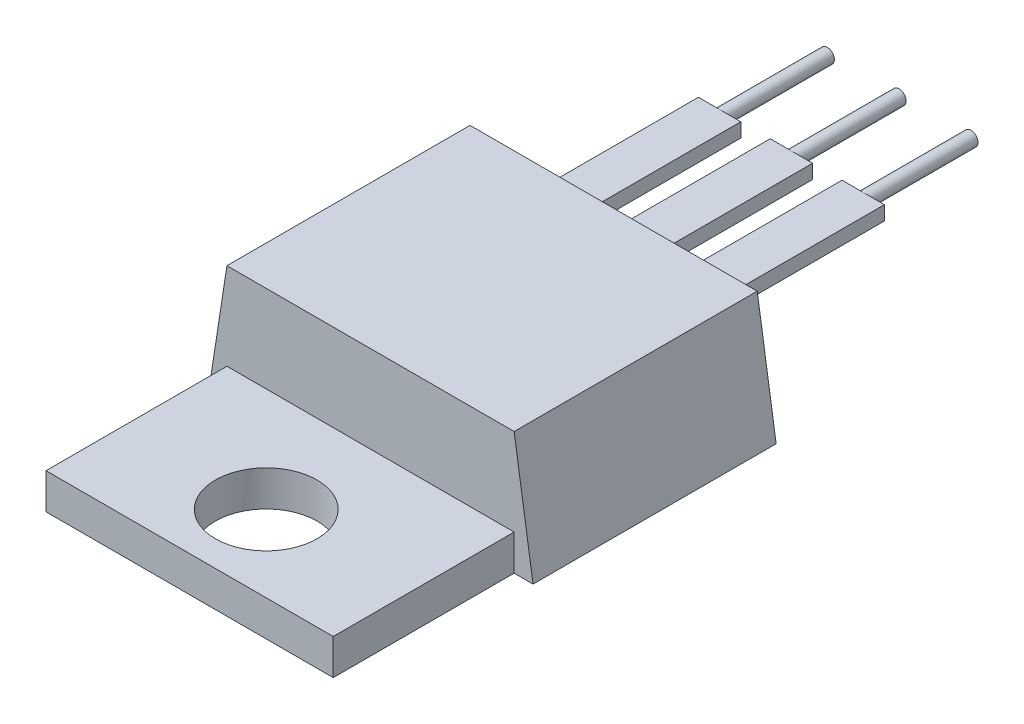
from build123d import *

# Parameters (mm, degrees)
EXTRUDE_1_DEPTH      = 8.6
EXTRUDE_2_DEPTH      = 6.4
EXTRUDE_2_DEPTH_BACK = 7.6
SKETCH_2_W           = 10.16
SKETCH_2_H           = 1.26
SKETCH_3_R           = 1.8
CUT_EXTRUDE_1_DEPTH  = 1.26
SKETCH_4_W           = 1.5
SKETCH_4_H           = 0.5
EXTRUDE_3_DEPTH      = 6.29
EXTRUDE_3_2_DEPTH    = 6.29
EXTRUDE_3_3_DEPTH    = 6.29
SKETCH_5_R           = 0.25
EXTRUDE_4_DEPTH      = 3.81


with BuildPart() as part:
    # Sketch 1 → Extrude 1 (new body)
    with BuildSketch(Plane.XY):
        Polygon((-5.75, -2.7), (5.75, -2.7), (5.08, 1.64), (-5.08, 1.64), align=None)
    extrude(amount=EXTRUDE_1_DEPTH)


with BuildPart() as body_2:
    # Sketch 2 → Extrude 2 (new, two sides: drawn at the far end of the back side and taken through both)
    with BuildSketch(Plane.XY.offset(8.6).offset(-EXTRUDE_2_DEPTH_BACK)):
        with Locations((0, -2.07)):
            Rectangle(SKETCH_2_W, SKETCH_2_H)
    extrude(amount=EXTRUDE_2_DEPTH + EXTRUDE_2_DEPTH_BACK)

    # Sketch 3 → Cut-Extrude 1 (cut)
    with BuildSketch(Plane(origin=(0, -1.44, 0), x_dir=(1, 0, 0), z_dir=(0, 1, 0))):
        with Locations(Location((0, -12.29, 0), (0, 0, 270))):
            Circle(SKETCH_3_R)
    extrude(amount=-CUT_EXTRUDE_1_DEPTH, mode=Mode.SUBTRACT)


with BuildPart() as body_3:
    # Sketch 4 → Extrude 3 (new body)
    with BuildSketch(Plane(origin=(0, 0, 0), x_dir=(-1, 0, 0), z_dir=(0, 0, -1))):
        Rectangle(SKETCH_4_W, SKETCH_4_H)
    extrude(amount=EXTRUDE_3_DEPTH)



with BuildPart() as body_4:
    # Sketch 4 → Extrude 3 2 (new body)
    with BuildSketch(Plane(origin=(0, 0, 0), x_dir=(-1, 0, 0), z_dir=(0, 0, -1))):
        with Locations((-2.54, 0)):
            Rectangle(SKETCH_4_W, SKETCH_4_H)
    extrude(amount=EXTRUDE_3_2_DEPTH)


with BuildPart() as body_5:
    # Sketch 4 → Extrude 3 3 (new body)
    with BuildSketch(Plane(origin=(0, 0, 0), x_dir=(-1, 0, 0), z_dir=(0, 0, -1))):
        with Locations((2.54, 0)):
            Rectangle(SKETCH_4_W, SKETCH_4_H)
    extrude(amount=EXTRUDE_3_3_DEPTH)


with BuildPart() as body_3_1:
    add(body_3.part)

    add(body_4.part)  # Extrude 4 merges body 4

    add(body_5.part)  # Extrude 4 merges body 5
    # Sketch 5 → Extrude 4 (add)
    with BuildSketch(Plane(origin=(0, 0, -6.29), x_dir=(-1, 0, 0), z_dir=(0, 0, -1))):
        with Locations(Location((0, 0, 0), (0, 0, 270))):
            Circle(SKETCH_5_R)
        with Locations(Location((-2.54, 0, 0), (0, 0, 270))):
            Circle(SKETCH_5_R)
        with Locations(Location((2.54, 0, 0), (0, 0, 270))):
            Circle(SKETCH_5_R)
    extrude(amount=EXTRUDE_4_DEPTH)


solid = Compound([part.part, body_2.part, body_3_1.part])
